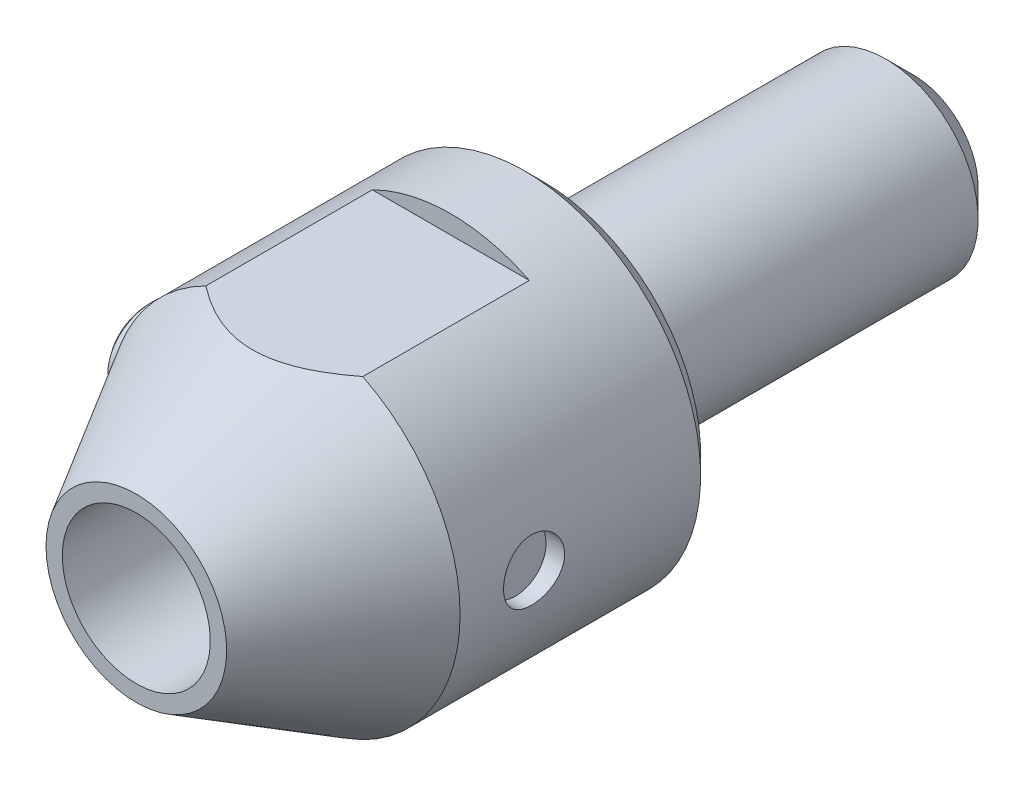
ISO-10303-21;
HEADER;
FILE_DESCRIPTION(('STEP AP214'),'2;1');
FILE_NAME('part.step','',(''),(''),'','','');
FILE_SCHEMA(('AUTOMOTIVE_DESIGN { 1 0 10303 214 1 1 1 1 }'));
ENDSEC;
DATA;
#1=APPLICATION_CONTEXT('core data for automotive mechanical design processes');
#2=APPLICATION_PROTOCOL_DEFINITION('international standard','automotive_design',2000,#1);
#3=PRODUCT_CONTEXT('',#1,'mechanical');
#4=PRODUCT('Part','Part','',(#3));
#5=PRODUCT_RELATED_PRODUCT_CATEGORY('part','',(#4));
#6=PRODUCT_DEFINITION_FORMATION('','',#4);
#7=PRODUCT_DEFINITION_CONTEXT('part definition',#1,'design');
#8=PRODUCT_DEFINITION('design','',#6,#7);
#9=PRODUCT_DEFINITION_SHAPE('','',#8);
#10=(LENGTH_UNIT() NAMED_UNIT(*) SI_UNIT(.MILLI.,.METRE.));
#11=(NAMED_UNIT(*) PLANE_ANGLE_UNIT() SI_UNIT($,.RADIAN.));
#12=(NAMED_UNIT(*) SI_UNIT($,.STERADIAN.) SOLID_ANGLE_UNIT());
#13=UNCERTAINTY_MEASURE_WITH_UNIT(LENGTH_MEASURE(1.E-05),#10,'distance_accuracy_value','');
#14=(GEOMETRIC_REPRESENTATION_CONTEXT(3) GLOBAL_UNCERTAINTY_ASSIGNED_CONTEXT((#13)) GLOBAL_UNIT_ASSIGNED_CONTEXT((#10,
#11,#12)) REPRESENTATION_CONTEXT('',''));
#15=CARTESIAN_POINT('',(0.,0.,0.));
#16=DIRECTION('',(0.,0.,1.));
#17=DIRECTION('',(1.,0.,0.));
#18=AXIS2_PLACEMENT_3D('',#15,#16,#17);
#19=CARTESIAN_POINT('',(-10.9197438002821,0.,9.80046802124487));
#20=DIRECTION('',(0.990268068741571,0.,0.139173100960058));
#21=DIRECTION('',(0.,-1.,0.));
#22=AXIS2_PLACEMENT_3D('',#19,#20,#21);
#23=CYLINDRICAL_SURFACE('',#22,2.5);
#24=CARTESIAN_POINT('',(-10.9197438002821,0.,9.80046802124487));
#25=DIRECTION('',(0.990268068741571,0.,0.139173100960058));
#26=DIRECTION('',(0.,-1.,0.));
#27=AXIS2_PLACEMENT_3D('',#24,#25,#26);
#28=CIRCLE('',#27,2.5);
#29=CARTESIAN_POINT('',(-10.9197438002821,-2.5,9.80046802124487));
#30=VERTEX_POINT('',#29);
#31=EDGE_CURVE('E108',#30,#30,#28,.T.);
#32=ORIENTED_EDGE('',*,*,#31,.T.);
#33=EDGE_LOOP('',(#32));
#34=FACE_BOUND('',#33,.T.);
#35=CARTESIAN_POINT('',(-9.16515138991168,-2.5,10.0470599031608));
#36=CARTESIAN_POINT('',(-9.16515522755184,-2.49999499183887,9.90369510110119));
#37=CARTESIAN_POINT('',(-9.16848757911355,-2.48786505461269,9.76027054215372));
#38=CARTESIAN_POINT('',(-9.18129149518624,-2.44017795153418,9.47758836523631));
#39=CARTESIAN_POINT('',(-9.19076901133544,-2.40459807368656,9.3383349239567));
#40=CARTESIAN_POINT('',(-9.21461263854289,-2.31153661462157,9.0681672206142));
#41=CARTESIAN_POINT('',(-9.22896785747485,-2.25410379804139,8.93723514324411));
#42=CARTESIAN_POINT('',(-9.26090841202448,-2.11905016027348,8.68668843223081));
#43=CARTESIAN_POINT('',(-9.27849380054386,-2.04142900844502,8.56707398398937));
#44=CARTESIAN_POINT('',(-9.31557662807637,-1.86504666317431,8.33849359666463));
#45=CARTESIAN_POINT('',(-9.3351176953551,-1.76567912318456,8.23000154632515));
#46=CARTESIAN_POINT('',(-9.37337809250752,-1.54976735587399,8.03148351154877));
#47=CARTESIAN_POINT('',(-9.39209739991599,-1.43322265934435,7.94145803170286));
#48=CARTESIAN_POINT('',(-9.42636174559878,-1.18700581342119,7.78375464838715));
#49=CARTESIAN_POINT('',(-9.44193537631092,-1.05746958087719,7.71587164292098));
#50=CARTESIAN_POINT('',(-9.46822993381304,-0.787970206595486,7.60411299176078));
#51=CARTESIAN_POINT('',(-9.47895343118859,-0.648012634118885,7.56022462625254));
#52=CARTESIAN_POINT('',(-9.4936823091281,-0.371387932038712,7.50052701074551));
#53=CARTESIAN_POINT('',(-9.49807728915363,-0.235093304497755,7.48308549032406));
#54=CARTESIAN_POINT('',(-9.50090574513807,0.0385133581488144,7.47182342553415));
#55=CARTESIAN_POINT('',(-9.49934096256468,0.175825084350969,7.47799598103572));
#56=CARTESIAN_POINT('',(-9.49064613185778,0.440961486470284,7.51283326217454));
#57=CARTESIAN_POINT('',(-9.48377306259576,0.568933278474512,7.54045971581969));
#58=CARTESIAN_POINT('',(-9.46550492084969,0.818461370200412,7.61580188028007));
#59=CARTESIAN_POINT('',(-9.45410941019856,0.940017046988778,7.66351953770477));
#60=CARTESIAN_POINT('',(-9.42762923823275,1.17657319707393,7.77867624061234));
#61=CARTESIAN_POINT('',(-9.41246292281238,1.29134759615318,7.84655932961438));
#62=CARTESIAN_POINT('',(-9.38009795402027,1.50859092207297,7.99937898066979));
#63=CARTESIAN_POINT('',(-9.36289866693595,1.61105599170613,8.08432086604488));
#64=CARTESIAN_POINT('',(-9.32695336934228,1.80793115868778,8.27504341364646));
#65=CARTESIAN_POINT('',(-9.30818019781,1.9013632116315,8.3818294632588));
#66=CARTESIAN_POINT('',(-9.27217150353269,2.06984953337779,8.60928788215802));
#67=CARTESIAN_POINT('',(-9.25493644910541,2.1448982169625,8.72996445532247));
#68=CARTESIAN_POINT('',(-9.22324530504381,2.27740979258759,8.98737222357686));
#69=CARTESIAN_POINT('',(-9.20893188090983,2.33402689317,9.12455844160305));
#70=CARTESIAN_POINT('',(-9.18581732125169,2.42340958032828,9.40694469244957));
#71=CARTESIAN_POINT('',(-9.17701521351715,2.45617937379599,9.55214330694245));
#72=CARTESIAN_POINT('',(-9.16629028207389,2.49590537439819,9.84280570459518));
#73=CARTESIAN_POINT('',(-9.16420987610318,2.50345303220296,9.98818221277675));
#74=CARTESIAN_POINT('',(-9.16688602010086,2.49363844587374,10.2780210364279));
#75=CARTESIAN_POINT('',(-9.17164039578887,2.47628412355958,10.4224836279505));
#76=CARTESIAN_POINT('',(-9.18710176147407,2.41826293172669,10.6991743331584));
#77=CARTESIAN_POINT('',(-9.197517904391,2.37873231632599,10.8316582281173));
#78=CARTESIAN_POINT('',(-9.2229236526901,2.27823374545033,11.0877536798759));
#79=CARTESIAN_POINT('',(-9.23791310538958,2.21726650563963,11.2113655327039));
#80=CARTESIAN_POINT('',(-9.27058829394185,2.07637729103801,11.4450422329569));
#81=CARTESIAN_POINT('',(-9.28824390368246,1.99666215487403,11.5552362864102));
#82=CARTESIAN_POINT('',(-9.32443932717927,1.82014579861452,11.760796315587));
#83=CARTESIAN_POINT('',(-9.34297922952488,1.72334286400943,11.8561608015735));
#84=CARTESIAN_POINT('',(-9.37932911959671,1.51319441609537,12.0314665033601));
#85=CARTESIAN_POINT('',(-9.39711747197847,1.39956005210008,12.1110660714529));
#86=CARTESIAN_POINT('',(-9.42964304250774,1.16034004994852,12.2504772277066));
#87=CARTESIAN_POINT('',(-9.44438011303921,1.03475383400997,12.3102878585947));
#88=CARTESIAN_POINT('',(-9.46935504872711,0.773732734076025,12.4091250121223));
#89=CARTESIAN_POINT('',(-9.47954521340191,0.638210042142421,12.4479320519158));
#90=CARTESIAN_POINT('',(-9.49409210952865,0.362333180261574,12.5027855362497));
#91=CARTESIAN_POINT('',(-9.49844911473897,0.221979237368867,12.5188330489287));
#92=CARTESIAN_POINT('',(-9.50084850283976,-0.0586058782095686,12.5277075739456));
#93=CARTESIAN_POINT('',(-9.49893143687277,-0.198832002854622,12.52068370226));
#94=CARTESIAN_POINT('',(-9.48907855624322,-0.476057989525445,12.4839325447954));
#95=CARTESIAN_POINT('',(-9.48114272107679,-0.613057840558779,12.4542051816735));
#96=CARTESIAN_POINT('',(-9.46012310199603,-0.879741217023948,12.3729007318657));
#97=CARTESIAN_POINT('',(-9.44704781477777,-1.00943641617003,12.3213596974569));
#98=CARTESIAN_POINT('',(-9.41714929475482,-1.25817629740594,12.1977440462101));
#99=CARTESIAN_POINT('',(-9.40032583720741,-1.37722034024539,12.1256681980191));
#100=CARTESIAN_POINT('',(-9.36461387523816,-1.60221560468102,11.9621693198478));
#101=CARTESIAN_POINT('',(-9.34571103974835,-1.70806365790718,11.8706073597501));
#102=CARTESIAN_POINT('',(-9.30804814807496,-1.90265208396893,11.6707626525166));
#103=CARTESIAN_POINT('',(-9.28928810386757,-1.99139103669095,11.5624785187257));
#104=CARTESIAN_POINT('',(-9.25414114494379,-2.14880601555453,11.3325879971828));
#105=CARTESIAN_POINT('',(-9.23774376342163,-2.21757199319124,11.211044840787));
#106=CARTESIAN_POINT('',(-9.20914126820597,-2.33351936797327,10.9576840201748));
#107=CARTESIAN_POINT('',(-9.19693269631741,-2.380718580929,10.8258749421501));
#108=CARTESIAN_POINT('',(-9.18021134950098,-2.4442845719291,10.5861571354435));
#109=CARTESIAN_POINT('',(-9.17458765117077,-2.46518799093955,10.4795027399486));
#110=CARTESIAN_POINT('',(-9.16705620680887,-2.49304764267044,10.2642636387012));
#111=CARTESIAN_POINT('',(-9.16514848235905,-2.50000379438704,10.1556789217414));
#112=CARTESIAN_POINT('',(-9.16515138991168,-2.5,10.0470599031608));
#113=B_SPLINE_CURVE_WITH_KNOTS('',3,(#35,#36,#37,#38,#39,#40,#41,#42,#43,#44,#45,#46,#47,#48,
#49,#50,#51,#52,#53,#54,#55,#56,#57,#58,#59,#60,#61,#62,#63,#64,#65,#66,#67,#68,#69,#70,#71,#72,
#73,#74,#75,#76,#77,#78,#79,#80,#81,#82,#83,#84,#85,#86,#87,#88,#89,#90,#91,#92,#93,#94,#95,#96,
#97,#98,#99,#100,#101,#102,#103,#104,#105,#106,#107,#108,#109,#110,#111,#112),.UNSPECIFIED.,.T.,
.F.,(4,2,2,2,2,2,2,2,2,2,2,2,2,2,2,2,2,2,2,2,2,2,2,2,2,2,2,2,2,2,2,2,2,2,2,2,2,2,4),(0.,
0.429680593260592,0.859777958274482,1.28892114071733,1.71807135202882,2.16120315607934,
2.60434706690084,3.04326124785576,3.48194252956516,3.89225538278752,4.30244835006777,
4.69394018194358,5.08546995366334,5.48635636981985,5.88736808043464,6.31484802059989,
6.74245767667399,7.18757441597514,7.63261261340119,8.06713871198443,8.50152660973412,
8.91545946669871,9.32937850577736,9.73892905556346,10.1485207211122,10.566198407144,
10.9838962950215,11.4058786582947,11.827841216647,12.2470819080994,12.6663240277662,
13.0848759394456,13.5034529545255,13.9251207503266,14.3468235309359,14.7665965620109,
15.1860221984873,15.511563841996,15.837107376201),.UNSPECIFIED.);
#114=CARTESIAN_POINT('',(-9.16515138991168,-2.5,10.0470599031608));
#115=VERTEX_POINT('',#114);
#116=EDGE_CURVE('E20',#115,#115,#113,.T.);
#117=ORIENTED_EDGE('',*,*,#116,.F.);
#118=EDGE_LOOP('',(#117));
#119=FACE_BOUND('',#118,.T.);
#120=ADVANCED_FACE('F16',(#34,#119),#23,.T.);
#121=CARTESIAN_POINT('',(-8.79208017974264,-1.25,10.8282719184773));
#122=DIRECTION('',(-0.120527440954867,-0.5,0.857597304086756));
#123=DIRECTION('',(0.0695865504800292,-0.866025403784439,-0.495134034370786));
#124=AXIS2_PLACEMENT_3D('',#121,#122,#123);
#125=PLANE('',#124);
#126=DIRECTION('',(-0.990268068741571,0.,-0.139173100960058));
#127=VECTOR('',#126,1.);
#128=CARTESIAN_POINT('',(-8.79208017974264,-1.25,10.8282719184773));
#129=LINE('',#128,#127);
#130=CARTESIAN_POINT('',(-8.79208017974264,-1.25,10.8282719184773));
#131=VERTEX_POINT('',#130);
#132=CARTESIAN_POINT('',(-11.2677503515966,-1.25,10.4803391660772));
#133=VERTEX_POINT('',#132);
#134=EDGE_CURVE('E104',#131,#133,#129,.T.);
#135=ORIENTED_EDGE('',*,*,#134,.T.);
#136=DIRECTION('',(-0.0695865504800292,0.866025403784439,0.495134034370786));
#137=VECTOR('',#136,1.);
#138=CARTESIAN_POINT('',(-11.2677503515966,-1.25,10.4803391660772));
#139=LINE('',#138,#137);
#140=CARTESIAN_POINT('',(-11.3681898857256,0.,11.1950035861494));
#141=VERTEX_POINT('',#140);
#142=EDGE_CURVE('E37',#133,#141,#139,.T.);
#143=ORIENTED_EDGE('',*,*,#142,.T.);
#144=DIRECTION('',(-0.990268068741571,0.,-0.139173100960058));
#145=VECTOR('',#144,1.);
#146=CARTESIAN_POINT('',(-8.8925197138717,0.,11.5429363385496));
#147=LINE('',#146,#145);
#148=CARTESIAN_POINT('',(-8.8925197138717,0.,11.5429363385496));
#149=VERTEX_POINT('',#148);
#150=EDGE_CURVE('E42',#149,#141,#147,.T.);
#151=ORIENTED_EDGE('',*,*,#150,.F.);
#152=DIRECTION('',(-0.0695865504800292,0.866025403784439,0.495134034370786));
#153=VECTOR('',#152,1.);
#154=CARTESIAN_POINT('',(-8.79208017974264,-1.25,10.8282719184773));
#155=LINE('',#154,#153);
#156=EDGE_CURVE('E98',#131,#149,#155,.T.);
#157=ORIENTED_EDGE('',*,*,#156,.F.);
#158=EDGE_LOOP('',(#135,#143,#151,#157));
#159=FACE_BOUND('',#158,.T.);
#160=ADVANCED_FACE('F118',(#159),#125,.F.);
#161=CARTESIAN_POINT('',(-8.59120111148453,-1.25,9.39894307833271));
#162=DIRECTION('',(0.,-1.,0.));
#163=DIRECTION('',(0.139173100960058,0.,-0.990268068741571));
#164=AXIS2_PLACEMENT_3D('',#161,#162,#163);
#165=PLANE('',#164);
#166=DIRECTION('',(-0.990268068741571,0.,-0.139173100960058));
#167=VECTOR('',#166,1.);
#168=CARTESIAN_POINT('',(-8.59120111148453,-1.25,9.39894307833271));
#169=LINE('',#168,#167);
#170=CARTESIAN_POINT('',(-8.59120111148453,-1.25,9.39894307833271));
#171=VERTEX_POINT('',#170);
#172=CARTESIAN_POINT('',(-11.0668712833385,-1.25,9.05101032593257));
#173=VERTEX_POINT('',#172);
#174=EDGE_CURVE('E101',#171,#173,#169,.T.);
#175=ORIENTED_EDGE('',*,*,#174,.T.);
#176=DIRECTION('',(-0.139173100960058,0.,0.990268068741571));
#177=VECTOR('',#176,1.);
#178=CARTESIAN_POINT('',(-11.0668712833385,-1.25,9.05101032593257));
#179=LINE('',#178,#177);
#180=EDGE_CURVE('E190',#173,#133,#179,.T.);
#181=ORIENTED_EDGE('',*,*,#180,.T.);
#182=ORIENTED_EDGE('',*,*,#134,.F.);
#183=DIRECTION('',(-0.139173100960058,0.,0.990268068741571));
#184=VECTOR('',#183,1.);
#185=CARTESIAN_POINT('',(-8.59120111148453,-1.25,9.39894307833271));
#186=LINE('',#185,#184);
#187=EDGE_CURVE('E93',#171,#131,#186,.T.);
#188=ORIENTED_EDGE('',*,*,#187,.F.);
#189=EDGE_LOOP('',(#175,#181,#182,#188));
#190=FACE_BOUND('',#189,.T.);
#191=ADVANCED_FACE('F124',(#190),#165,.F.);
#192=CARTESIAN_POINT('',(-8.59120111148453,-1.25,9.39894307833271));
#193=DIRECTION('',(-0.120527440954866,0.5,0.857597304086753));
#194=DIRECTION('',(-0.0695865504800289,-0.866025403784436,0.495134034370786));
#195=AXIS2_PLACEMENT_3D('',#192,#193,#194);
#196=PLANE('',#195);
#197=DIRECTION('',(-0.990268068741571,0.,-0.139173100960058));
#198=VECTOR('',#197,1.);
#199=CARTESIAN_POINT('',(-8.49076157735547,0.,8.68427865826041));
#200=LINE('',#199,#198);
#201=CARTESIAN_POINT('',(-8.49076157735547,0.,8.68427865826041));
#202=VERTEX_POINT('',#201);
#203=CARTESIAN_POINT('',(-10.9664317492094,0.,8.33634590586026));
#204=VERTEX_POINT('',#203);
#205=EDGE_CURVE('E76',#202,#204,#200,.T.);
#206=ORIENTED_EDGE('',*,*,#205,.T.);
#207=DIRECTION('',(0.0695865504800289,0.866025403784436,-0.495134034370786));
#208=VECTOR('',#207,1.);
#209=CARTESIAN_POINT('',(-11.0668712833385,-1.25,9.05101032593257));
#210=LINE('',#209,#208);
#211=EDGE_CURVE('E334',#173,#204,#210,.T.);
#212=ORIENTED_EDGE('',*,*,#211,.F.);
#213=ORIENTED_EDGE('',*,*,#174,.F.);
#214=DIRECTION('',(0.0695865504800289,0.866025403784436,-0.495134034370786));
#215=VECTOR('',#214,1.);
#216=CARTESIAN_POINT('',(-8.59120111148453,-1.25,9.39894307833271));
#217=LINE('',#216,#215);
#218=EDGE_CURVE('E91',#171,#202,#217,.T.);
#219=ORIENTED_EDGE('',*,*,#218,.T.);
#220=EDGE_LOOP('',(#206,#212,#213,#219));
#221=FACE_BOUND('',#220,.T.);
#222=ADVANCED_FACE('F303',(#221),#196,.T.);
#223=CARTESIAN_POINT('',(-8.59120111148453,1.25,9.39894307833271));
#224=DIRECTION('',(0.120527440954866,0.5,-0.857597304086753));
#225=DIRECTION('',(-0.0695865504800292,0.866025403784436,0.495134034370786));
#226=AXIS2_PLACEMENT_3D('',#223,#224,#225);
#227=PLANE('',#226);
#228=DIRECTION('',(-0.990268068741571,0.,-0.139173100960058));
#229=VECTOR('',#228,1.);
#230=CARTESIAN_POINT('',(-8.59120111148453,1.25,9.39894307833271));
#231=LINE('',#230,#229);
#232=CARTESIAN_POINT('',(-8.59120111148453,1.25,9.39894307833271));
#233=VERTEX_POINT('',#232);
#234=CARTESIAN_POINT('',(-11.0668712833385,1.25,9.05101032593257));
#235=VERTEX_POINT('',#234);
#236=EDGE_CURVE('E64',#233,#235,#231,.T.);
#237=ORIENTED_EDGE('',*,*,#236,.T.);
#238=DIRECTION('',(0.0695865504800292,-0.866025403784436,-0.495134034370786));
#239=VECTOR('',#238,1.);
#240=CARTESIAN_POINT('',(-11.0668712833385,1.25,9.05101032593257));
#241=LINE('',#240,#239);
#242=EDGE_CURVE('E329',#235,#204,#241,.T.);
#243=ORIENTED_EDGE('',*,*,#242,.T.);
#244=ORIENTED_EDGE('',*,*,#205,.F.);
#245=DIRECTION('',(0.0695865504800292,-0.866025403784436,-0.495134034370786));
#246=VECTOR('',#245,1.);
#247=CARTESIAN_POINT('',(-8.59120111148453,1.25,9.39894307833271));
#248=LINE('',#247,#246);
#249=EDGE_CURVE('E84',#233,#202,#248,.T.);
#250=ORIENTED_EDGE('',*,*,#249,.F.);
#251=EDGE_LOOP('',(#237,#243,#244,#250));
#252=FACE_BOUND('',#251,.T.);
#253=ADVANCED_FACE('F89',(#252),#227,.F.);
#254=CARTESIAN_POINT('',(-8.59120111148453,1.25,9.39894307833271));
#255=DIRECTION('',(0.,-1.,0.));
#256=DIRECTION('',(-0.990268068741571,0.,-0.139173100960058));
#257=AXIS2_PLACEMENT_3D('',#254,#255,#256);
#258=PLANE('',#257);
#259=DIRECTION('',(-0.990268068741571,0.,-0.139173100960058));
#260=VECTOR('',#259,1.);
#261=CARTESIAN_POINT('',(-8.79208017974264,1.25,10.8282719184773));
#262=LINE('',#261,#260);
#263=CARTESIAN_POINT('',(-8.79208017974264,1.25,10.8282719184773));
#264=VERTEX_POINT('',#263);
#265=CARTESIAN_POINT('',(-11.2677503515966,1.25,10.4803391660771));
#266=VERTEX_POINT('',#265);
#267=EDGE_CURVE('E77',#264,#266,#262,.T.);
#268=ORIENTED_EDGE('',*,*,#267,.T.);
#269=DIRECTION('',(-0.139173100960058,0.,0.990268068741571));
#270=VECTOR('',#269,1.);
#271=CARTESIAN_POINT('',(-11.0668712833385,1.25,9.05101032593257));
#272=LINE('',#271,#270);
#273=EDGE_CURVE('E71',#235,#266,#272,.T.);
#274=ORIENTED_EDGE('',*,*,#273,.F.);
#275=ORIENTED_EDGE('',*,*,#236,.F.);
#276=DIRECTION('',(-0.139173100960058,0.,0.990268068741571));
#277=VECTOR('',#276,1.);
#278=CARTESIAN_POINT('',(-8.59120111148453,1.25,9.39894307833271));
#279=LINE('',#278,#277);
#280=EDGE_CURVE('E68',#233,#264,#279,.T.);
#281=ORIENTED_EDGE('',*,*,#280,.T.);
#282=EDGE_LOOP('',(#268,#274,#275,#281));
#283=FACE_BOUND('',#282,.T.);
#284=ADVANCED_FACE('F67',(#283),#258,.T.);
#285=CARTESIAN_POINT('',(-8.79208017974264,1.25,10.8282719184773));
#286=DIRECTION('',(0.120527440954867,-0.5,-0.857597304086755));
#287=DIRECTION('',(0.0695865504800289,0.866025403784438,-0.495134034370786));
#288=AXIS2_PLACEMENT_3D('',#285,#286,#287);
#289=PLANE('',#288);
#290=DIRECTION('',(-0.0695865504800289,-0.866025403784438,0.495134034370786));
#291=VECTOR('',#290,1.);
#292=CARTESIAN_POINT('',(-8.79208017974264,1.25,10.8282719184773));
#293=LINE('',#292,#291);
#294=EDGE_CURVE('E87',#264,#149,#293,.T.);
#295=ORIENTED_EDGE('',*,*,#294,.T.);
#296=ORIENTED_EDGE('',*,*,#150,.T.);
#297=DIRECTION('',(-0.0695865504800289,-0.866025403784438,0.495134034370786));
#298=VECTOR('',#297,1.);
#299=CARTESIAN_POINT('',(-11.2677503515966,1.25,10.4803391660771));
#300=LINE('',#299,#298);
#301=EDGE_CURVE('E323',#266,#141,#300,.T.);
#302=ORIENTED_EDGE('',*,*,#301,.F.);
#303=ORIENTED_EDGE('',*,*,#267,.F.);
#304=EDGE_LOOP('',(#295,#296,#302,#303));
#305=FACE_BOUND('',#304,.T.);
#306=ADVANCED_FACE('F294',(#305),#289,.T.);
#307=CARTESIAN_POINT('',(-8.69164064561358,-2.5,10.113607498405));
#308=DIRECTION('',(-0.990268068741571,0.,-0.139173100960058));
#309=DIRECTION('',(0.,1.,0.));
#310=AXIS2_PLACEMENT_3D('',#307,#308,#309);
#311=PLANE('',#310);
#312=ORIENTED_EDGE('',*,*,#156,.T.);
#313=ORIENTED_EDGE('',*,*,#294,.F.);
#314=ORIENTED_EDGE('',*,*,#280,.F.);
#315=ORIENTED_EDGE('',*,*,#249,.T.);
#316=ORIENTED_EDGE('',*,*,#218,.F.);
#317=ORIENTED_EDGE('',*,*,#187,.T.);
#318=EDGE_LOOP('',(#312,#313,#314,#315,#316,#317));
#319=FACE_BOUND('',#318,.T.);
#320=ADVANCED_FACE('F82',(#319),#311,.T.);
#321=CARTESIAN_POINT('',(-10.9197438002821,0.,9.80046802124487));
#322=DIRECTION('',(0.990268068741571,0.,0.139173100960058));
#323=DIRECTION('',(0.,-1.,0.));
#324=AXIS2_PLACEMENT_3D('',#321,#322,#323);
#325=CONICAL_SURFACE('',#324,2.5,0.785398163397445);
#326=CARTESIAN_POINT('',(-11.1673108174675,0.,9.76567474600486));
#327=DIRECTION('',(0.990268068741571,0.,0.139173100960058));
#328=DIRECTION('',(0.,-1.,0.));
#329=AXIS2_PLACEMENT_3D('',#326,#327,#328);
#330=CIRCLE('',#329,2.25);
#331=CARTESIAN_POINT('',(-11.1673108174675,-2.25000000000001,9.76567474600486));
#332=VERTEX_POINT('',#331);
#333=EDGE_CURVE('E106',#332,#332,#330,.T.);
#334=CARTESIAN_POINT('',(-11.1673108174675,-2.25000000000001,9.76567474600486));
#335=CARTESIAN_POINT('',(-11.1647319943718,-2.25260416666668,9.76603717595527));
#336=CARTESIAN_POINT('',(-11.1621531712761,-2.25520833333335,9.76639960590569));
#337=CARTESIAN_POINT('',(-11.1569955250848,-2.26041666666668,9.76712446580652));
#338=CARTESIAN_POINT('',(-11.1544167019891,-2.26302083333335,9.76748689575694));
#339=CARTESIAN_POINT('',(-11.1492590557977,-2.26822916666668,9.76821175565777));
#340=CARTESIAN_POINT('',(-11.1466802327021,-2.27083333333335,9.76857418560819));
#341=CARTESIAN_POINT('',(-11.1415225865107,-2.27604166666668,9.76929904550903));
#342=CARTESIAN_POINT('',(-11.138943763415,-2.27864583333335,9.76966147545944));
#343=CARTESIAN_POINT('',(-11.1337861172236,-2.28385416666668,9.77038633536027));
#344=CARTESIAN_POINT('',(-11.131207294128,-2.28645833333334,9.77074876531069));
#345=CARTESIAN_POINT('',(-11.1260496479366,-2.29166666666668,9.77147362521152));
#346=CARTESIAN_POINT('',(-11.1234708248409,-2.29427083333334,9.77183605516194));
#347=CARTESIAN_POINT('',(-11.1183131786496,-2.29947916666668,9.77256091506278));
#348=CARTESIAN_POINT('',(-11.1157343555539,-2.30208333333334,9.77292334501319));
#349=CARTESIAN_POINT('',(-11.1105767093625,-2.30729166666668,9.77364820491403));
#350=CARTESIAN_POINT('',(-11.1079978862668,-2.30989583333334,9.77401063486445));
#351=CARTESIAN_POINT('',(-11.1028402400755,-2.31510416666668,9.77473549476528));
#352=CARTESIAN_POINT('',(-11.1002614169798,-2.31770833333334,9.77509792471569));
#353=CARTESIAN_POINT('',(-11.0951037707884,-2.32291666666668,9.77582278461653));
#354=CARTESIAN_POINT('',(-11.0925249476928,-2.32552083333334,9.77618521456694));
#355=CARTESIAN_POINT('',(-11.0873673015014,-2.33072916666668,9.77691007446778));
#356=CARTESIAN_POINT('',(-11.0847884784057,-2.33333333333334,9.7772725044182));
#357=CARTESIAN_POINT('',(-11.0796308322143,-2.33854166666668,9.77799736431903));
#358=CARTESIAN_POINT('',(-11.0770520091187,-2.34114583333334,9.77835979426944));
#359=CARTESIAN_POINT('',(-11.0718943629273,-2.34635416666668,9.77908465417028));
#360=CARTESIAN_POINT('',(-11.0693155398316,-2.34895833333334,9.7794470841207));
#361=CARTESIAN_POINT('',(-11.0641578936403,-2.35416666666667,9.78017194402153));
#362=CARTESIAN_POINT('',(-11.0615790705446,-2.35677083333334,9.78053437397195));
#363=CARTESIAN_POINT('',(-11.0564214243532,-2.36197916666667,9.78125923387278));
#364=CARTESIAN_POINT('',(-11.0538426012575,-2.36458333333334,9.7816216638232));
#365=CARTESIAN_POINT('',(-11.0486849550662,-2.36979166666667,9.78234652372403));
#366=CARTESIAN_POINT('',(-11.0461061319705,-2.37239583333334,9.78270895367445));
#367=CARTESIAN_POINT('',(-11.0409484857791,-2.37760416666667,9.78343381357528));
#368=CARTESIAN_POINT('',(-11.0383696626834,-2.38020833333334,9.7837962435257));
#369=CARTESIAN_POINT('',(-11.0332120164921,-2.38541666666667,9.78452110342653));
#370=CARTESIAN_POINT('',(-11.0306331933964,-2.38802083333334,9.78488353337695));
#371=CARTESIAN_POINT('',(-11.025475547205,-2.39322916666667,9.78560839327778));
#372=CARTESIAN_POINT('',(-11.0228967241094,-2.39583333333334,9.7859708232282));
#373=CARTESIAN_POINT('',(-11.017739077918,-2.40104166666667,9.78669568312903));
#374=CARTESIAN_POINT('',(-11.0151602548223,-2.40364583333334,9.78705811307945));
#375=CARTESIAN_POINT('',(-11.010002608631,-2.40885416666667,9.78778297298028));
#376=CARTESIAN_POINT('',(-11.0074237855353,-2.41145833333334,9.7881454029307));
#377=CARTESIAN_POINT('',(-11.0022661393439,-2.41666666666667,9.78887026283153));
#378=CARTESIAN_POINT('',(-10.9996873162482,-2.41927083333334,9.78923269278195));
#379=CARTESIAN_POINT('',(-10.9945296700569,-2.42447916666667,9.78995755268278));
#380=CARTESIAN_POINT('',(-10.9919508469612,-2.42708333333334,9.7903199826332));
#381=CARTESIAN_POINT('',(-10.9867932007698,-2.43229166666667,9.79104484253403));
#382=CARTESIAN_POINT('',(-10.9842143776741,-2.43489583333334,9.79140727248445));
#383=CARTESIAN_POINT('',(-10.9790567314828,-2.44010416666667,9.79213213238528));
#384=CARTESIAN_POINT('',(-10.9764779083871,-2.44270833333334,9.7924945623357));
#385=CARTESIAN_POINT('',(-10.9713202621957,-2.44791666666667,9.79321942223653));
#386=CARTESIAN_POINT('',(-10.9687414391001,-2.45052083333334,9.79358185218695));
#387=CARTESIAN_POINT('',(-10.9635837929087,-2.45572916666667,9.79430671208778));
#388=CARTESIAN_POINT('',(-10.961004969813,-2.45833333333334,9.7946691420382));
#389=CARTESIAN_POINT('',(-10.9558473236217,-2.46354166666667,9.79539400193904));
#390=CARTESIAN_POINT('',(-10.953268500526,-2.46614583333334,9.79575643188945));
#391=CARTESIAN_POINT('',(-10.9481108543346,-2.47135416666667,9.79648129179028));
#392=CARTESIAN_POINT('',(-10.9455320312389,-2.47395833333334,9.7968437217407));
#393=CARTESIAN_POINT('',(-10.9403743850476,-2.47916666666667,9.79756858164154));
#394=CARTESIAN_POINT('',(-10.9377955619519,-2.48177083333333,9.79793101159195));
#395=CARTESIAN_POINT('',(-10.9326379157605,-2.48697916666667,9.79865587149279));
#396=CARTESIAN_POINT('',(-10.9300590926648,-2.48958333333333,9.7990183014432));
#397=CARTESIAN_POINT('',(-10.9249014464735,-2.49479166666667,9.79974316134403));
#398=CARTESIAN_POINT('',(-10.9223226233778,-2.49739583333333,9.80010559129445));
#399=CARTESIAN_POINT('',(-10.9197438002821,-2.5,9.80046802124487));
#400=B_SPLINE_CURVE_WITH_KNOTS('',3,(#334,#335,#336,#337,#338,#339,#340,#341,#342,#343,#344,
#345,#346,#347,#348,#349,#350,#351,#352,#353,#354,#355,#356,#357,#358,#359,#360,#361,#362,#363,
#364,#365,#366,#367,#368,#369,#370,#371,#372,#373,#374,#375,#376,#377,#378,#379,#380,#381,#382,
#383,#384,#385,#386,#387,#388,#389,#390,#391,#392,#393,#394,#395,#396,#397,#398,#399),
.UNSPECIFIED.,.F.,.F.,(4,2,2,2,2,2,2,2,2,2,2,2,2,2,2,2,2,2,2,2,2,2,2,2,2,2,2,2,2,2,2,2,4),(0.,
0.0110485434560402,0.0220970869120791,0.0331456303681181,0.0441941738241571,0.0552427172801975,
0.0662912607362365,0.0773398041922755,0.0883883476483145,0.0994368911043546,0.110485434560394,
0.121533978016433,0.132582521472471,0.143631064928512,0.154679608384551,0.16572815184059,
0.176776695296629,0.187825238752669,0.198873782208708,0.209922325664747,0.220970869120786,
0.232019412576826,0.243067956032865,0.254116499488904,0.265165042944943,0.276213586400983,
0.287262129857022,0.298310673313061,0.3093592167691,0.320407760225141,0.33145630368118,
0.342504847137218,0.353553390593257),.UNSPECIFIED.);
#401=EDGE_CURVE('BSEAM128',#332,#30,#400,.T.);
#402=ORIENTED_EDGE('',*,*,#333,.T.);
#403=ORIENTED_EDGE('',*,*,#31,.F.);
#404=ORIENTED_EDGE('',*,*,#401,.T.);
#405=ORIENTED_EDGE('',*,*,#401,.F.);
#406=EDGE_LOOP('',(#402,#404,#403,#405));
#407=FACE_BOUND('',#406,.T.);
#408=ADVANCED_FACE('F128',(#407),#325,.T.);
#409=CARTESIAN_POINT('',(-11.1673108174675,0.,9.76567474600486));
#410=DIRECTION('',(0.990268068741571,0.,0.139173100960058));
#411=DIRECTION('',(0.,-1.,0.));
#412=AXIS2_PLACEMENT_3D('',#409,#410,#411);
#413=PLANE('',#412);
#414=ORIENTED_EDGE('',*,*,#301,.T.);
#415=ORIENTED_EDGE('',*,*,#142,.F.);
#416=ORIENTED_EDGE('',*,*,#180,.F.);
#417=ORIENTED_EDGE('',*,*,#211,.T.);
#418=ORIENTED_EDGE('',*,*,#242,.F.);
#419=ORIENTED_EDGE('',*,*,#273,.T.);
#420=EDGE_LOOP('',(#414,#415,#416,#417,#418,#419));
#421=FACE_BOUND('',#420,.T.);
#422=ORIENTED_EDGE('',*,*,#333,.F.);
#423=EDGE_LOOP('',(#422));
#424=FACE_BOUND('',#423,.T.);
#425=ADVANCED_FACE('F309',(#421,#424),#413,.F.);
#426=CARTESIAN_POINT('',(0.,0.,-15.004417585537));
#427=DIRECTION('',(0.,0.,-1.));
#428=DIRECTION('',(-1.,0.,0.));
#429=AXIS2_PLACEMENT_3D('',#426,#427,#428);
#430=CYLINDRICAL_SURFACE('',#429,5.);
#431=CARTESIAN_POINT('',(0.,0.,-18.5));
#432=DIRECTION('',(0.,0.,-1.));
#433=DIRECTION('',(-1.,0.,0.));
#434=AXIS2_PLACEMENT_3D('',#431,#432,#433);
#435=CIRCLE('',#434,5.);
#436=CARTESIAN_POINT('',(-5.,0.,-18.5));
#437=VERTEX_POINT('',#436);
#438=EDGE_CURVE('E155',#437,#437,#435,.T.);
#439=ORIENTED_EDGE('',*,*,#438,.F.);
#440=EDGE_LOOP('',(#439));
#441=FACE_BOUND('',#440,.T.);
#442=CARTESIAN_POINT('',(0.,0.,0.));
#443=DIRECTION('',(0.,0.,1.));
#444=DIRECTION('',(1.,0.,0.));
#445=AXIS2_PLACEMENT_3D('',#442,#443,#444);
#446=CIRCLE('',#445,5.);
#447=CARTESIAN_POINT('',(5.,0.,0.));
#448=VERTEX_POINT('',#447);
#449=EDGE_CURVE('E360',#448,#448,#446,.T.);
#450=ORIENTED_EDGE('',*,*,#449,.F.);
#451=EDGE_LOOP('',(#450));
#452=FACE_BOUND('',#451,.T.);
#453=ADVANCED_FACE('F311',(#441,#452),#430,.T.);
#454=CARTESIAN_POINT('',(0.,0.,-18.5));
#455=DIRECTION('',(0.,0.,1.));
#456=DIRECTION('',(1.,0.,0.));
#457=AXIS2_PLACEMENT_3D('',#454,#455,#456);
#458=CONICAL_SURFACE('',#457,5.,0.785398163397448);
#459=CARTESIAN_POINT('',(0.,0.,-20.));
#460=DIRECTION('',(0.,0.,-1.));
#461=DIRECTION('',(-1.,0.,0.));
#462=AXIS2_PLACEMENT_3D('',#459,#460,#461);
#463=CIRCLE('',#462,3.5);
#464=CARTESIAN_POINT('',(-3.5,0.,-20.));
#465=VERTEX_POINT('',#464);
#466=EDGE_CURVE('E152',#465,#465,#463,.T.);
#467=ORIENTED_EDGE('',*,*,#466,.F.);
#468=EDGE_LOOP('',(#467));
#469=FACE_BOUND('',#468,.T.);
#470=ORIENTED_EDGE('',*,*,#438,.T.);
#471=EDGE_LOOP('',(#470));
#472=FACE_BOUND('',#471,.T.);
#473=ADVANCED_FACE('F317',(#469,#472),#458,.T.);
#474=CARTESIAN_POINT('',(3.5,0.,-20.));
#475=DIRECTION('',(0.,0.,1.));
#476=DIRECTION('',(1.,0.,0.));
#477=AXIS2_PLACEMENT_3D('',#474,#475,#476);
#478=PLANE('',#477);
#479=ORIENTED_EDGE('',*,*,#466,.T.);
#480=EDGE_LOOP('',(#479));
#481=FACE_BOUND('',#480,.T.);
#482=ADVANCED_FACE('F203',(#481),#478,.F.);
#483=CARTESIAN_POINT('',(13.2740740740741,-14.0111111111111,5.));
#484=DIRECTION('',(0.,0.,1.));
#485=DIRECTION('',(1.,0.,0.));
#486=AXIS2_PLACEMENT_3D('',#483,#484,#485);
#487=PLANE('',#486);
#488=CARTESIAN_POINT('',(0.,0.,5.));
#489=DIRECTION('',(0.,0.,1.));
#490=DIRECTION('',(1.,0.,0.));
#491=AXIS2_PLACEMENT_3D('',#488,#489,#490);
#492=CIRCLE('',#491,9.5);
#493=CARTESIAN_POINT('',(-4.24264068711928,-8.5,5.));
#494=VERTEX_POINT('',#493);
#495=CARTESIAN_POINT('',(4.24264068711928,-8.5,5.));
#496=VERTEX_POINT('',#495);
#497=EDGE_CURVE('E175',#494,#496,#492,.T.);
#498=ORIENTED_EDGE('',*,*,#497,.T.);
#499=DIRECTION('',(-1.,0.,0.));
#500=VECTOR('',#499,1.);
#501=CARTESIAN_POINT('',(-12.9777777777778,-8.5,5.));
#502=LINE('',#501,#500);
#503=EDGE_CURVE('E220',#496,#494,#502,.T.);
#504=ORIENTED_EDGE('',*,*,#503,.T.);
#505=EDGE_LOOP('',(#498,#504));
#506=FACE_BOUND('',#505,.T.);
#507=ADVANCED_FACE('F199',(#506),#487,.T.);
#508=CARTESIAN_POINT('',(-12.9777777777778,-8.5,5.));
#509=DIRECTION('',(0.,1.,0.));
#510=DIRECTION('',(0.,0.,1.));
#511=AXIS2_PLACEMENT_3D('',#508,#509,#510);
#512=PLANE('',#511);
#513=CARTESIAN_POINT('',(-11.2948804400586,-8.5,5.97034551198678));
#514=CARTESIAN_POINT('',(-11.1012702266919,-8.5,6.238262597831));
#515=CARTESIAN_POINT('',(-10.9065004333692,-8.5,6.50534835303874));
#516=CARTESIAN_POINT('',(-10.5142434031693,-8.5,7.03754475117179));
#517=CARTESIAN_POINT('',(-10.3167559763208,-8.5,7.30265525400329));
#518=CARTESIAN_POINT('',(-9.91825207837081,-8.5,7.83113501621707));
#519=CARTESIAN_POINT('',(-9.7172287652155,-8.5,8.0944991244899));
#520=CARTESIAN_POINT('',(-9.31159460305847,-8.5,8.61844426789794));
#521=CARTESIAN_POINT('',(-9.10698383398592,-8.5,8.8790253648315));
#522=CARTESIAN_POINT('',(-8.68421863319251,-8.5,9.4085776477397));
#523=CARTESIAN_POINT('',(-8.46587044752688,-8.5,9.67739449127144));
#524=CARTESIAN_POINT('',(-8.02376944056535,-8.5,10.2105436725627));
#525=CARTESIAN_POINT('',(-7.80001679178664,-8.5,10.4748761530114));
#526=CARTESIAN_POINT('',(-7.34624954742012,-8.5,10.9977081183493));
#527=CARTESIAN_POINT('',(-7.11624083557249,-8.5,11.2562126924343));
#528=CARTESIAN_POINT('',(-6.64845621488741,-8.5,11.7660708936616));
#529=CARTESIAN_POINT('',(-6.41068124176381,-8.5,12.0174253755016));
#530=CARTESIAN_POINT('',(-5.91764934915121,-8.5,12.5189806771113));
#531=CARTESIAN_POINT('',(-5.66207459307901,-8.5,12.7688709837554));
#532=CARTESIAN_POINT('',(-5.13820420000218,-8.5,13.2554549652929));
#533=CARTESIAN_POINT('',(-4.86990002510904,-8.5,13.4921395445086));
#534=CARTESIAN_POINT('',(-4.32100945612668,-8.5,13.9441737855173));
#535=CARTESIAN_POINT('',(-4.04060381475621,-8.5,14.1597409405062));
#536=CARTESIAN_POINT('',(-3.4615991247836,-8.5,14.5646140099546));
#537=CARTESIAN_POINT('',(-3.16303159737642,-8.5,14.7539636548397));
#538=CARTESIAN_POINT('',(-2.72436176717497,-8.5,14.9957844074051));
#539=CARTESIAN_POINT('',(-2.59285642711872,-8.5,15.0639175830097));
#540=CARTESIAN_POINT('',(-2.32577323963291,-8.5,15.1924988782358));
#541=CARTESIAN_POINT('',(-2.19018752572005,-8.5,15.2529307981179));
#542=CARTESIAN_POINT('',(-1.91417804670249,-8.5,15.3651539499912));
#543=CARTESIAN_POINT('',(-1.77372395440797,-8.5,15.4168711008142));
#544=CARTESIAN_POINT('',(-1.48936421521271,-8.5,15.5097121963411));
#545=CARTESIAN_POINT('',(-1.34545939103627,-8.5,15.5508386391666));
#546=CARTESIAN_POINT('',(-1.05482723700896,-8.5,15.6212114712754));
#547=CARTESIAN_POINT('',(-0.908101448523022,-8.5,15.6504641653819));
#548=CARTESIAN_POINT('',(-0.612650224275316,-8.5,15.6960578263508));
#549=CARTESIAN_POINT('',(-0.4639249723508,-8.5,15.7123999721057));
#550=CARTESIAN_POINT('',(-0.164735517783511,-8.5,15.7315752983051));
#551=CARTESIAN_POINT('',(-0.0142662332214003,-8.5,15.7343301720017));
#552=CARTESIAN_POINT('',(0.286284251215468,-8.5,15.7260022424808));
#553=CARTESIAN_POINT('',(0.436365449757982,-8.5,15.7149193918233));
#554=CARTESIAN_POINT('',(0.734912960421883,-8.5,15.6793770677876));
#555=CARTESIAN_POINT('',(0.883379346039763,-8.5,15.6549182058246));
#556=CARTESIAN_POINT('',(1.17770792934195,-8.5,15.5935642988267));
#557=CARTESIAN_POINT('',(1.32356973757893,-8.5,15.5566674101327));
#558=CARTESIAN_POINT('',(1.65950421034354,-8.5,15.4576557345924));
#559=CARTESIAN_POINT('',(1.84830908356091,-8.5,15.3912375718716));
#560=CARTESIAN_POINT('',(2.21923241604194,-8.5,15.2417524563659));
#561=CARTESIAN_POINT('',(2.40134646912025,-8.5,15.1586747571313));
#562=CARTESIAN_POINT('',(2.75929719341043,-8.5,14.978603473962));
#563=CARTESIAN_POINT('',(2.93510953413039,-8.5,14.8815619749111));
#564=CARTESIAN_POINT('',(3.28005082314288,-8.5,14.6764120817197));
#565=CARTESIAN_POINT('',(3.44918082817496,-8.5,14.5683054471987));
#566=CARTESIAN_POINT('',(3.85096923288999,-8.5,14.2959391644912));
#567=CARTESIAN_POINT('',(4.08053904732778,-8.5,14.1271370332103));
#568=CARTESIAN_POINT('',(4.52917768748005,-8.5,13.776045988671));
#569=CARTESIAN_POINT('',(4.7482408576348,-8.5,13.5937499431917));
#570=CARTESIAN_POINT('',(5.17784409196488,-8.5,13.2185661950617));
#571=CARTESIAN_POINT('',(5.38836564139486,-8.5,13.0256574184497));
#572=CARTESIAN_POINT('',(5.80177981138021,-8.5,12.6319524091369));
#573=CARTESIAN_POINT('',(6.00467385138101,-8.5,12.4311576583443));
#574=CARTESIAN_POINT('',(6.40660991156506,-8.5,12.0207112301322));
#575=CARTESIAN_POINT('',(6.6055694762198,-8.5,11.8109791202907));
#576=CARTESIAN_POINT('',(6.99792757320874,-8.5,11.3863779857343));
#577=CARTESIAN_POINT('',(7.19132588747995,-8.5,11.1715087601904));
#578=CARTESIAN_POINT('',(7.57312110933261,-8.5,10.7378836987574));
#579=CARTESIAN_POINT('',(7.76152426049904,-8.5,10.5191333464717));
#580=CARTESIAN_POINT('',(8.13425170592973,-8.5,10.078207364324));
#581=CARTESIAN_POINT('',(8.31857616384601,-8.5,9.85603187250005));
#582=CARTESIAN_POINT('',(8.72039700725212,-8.5,9.36387271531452));
#583=CARTESIAN_POINT('',(8.93711530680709,-8.5,9.09325445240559));
#584=CARTESIAN_POINT('',(9.36625758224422,-8.5,8.54862897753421));
#585=CARTESIAN_POINT('',(9.57868143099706,-8.5,8.27462166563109));
#586=CARTESIAN_POINT('',(9.99987872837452,-8.5,7.72376526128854));
#587=CARTESIAN_POINT('',(10.2086517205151,-8.5,7.44691582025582));
#588=CARTESIAN_POINT('',(10.6230265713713,-8.5,6.89085175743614));
#589=CARTESIAN_POINT('',(10.8286283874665,-8.5,6.61163710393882));
#590=CARTESIAN_POINT('',(11.4415050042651,-8.5,5.77074591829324));
#591=CARTESIAN_POINT('',(11.8446639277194,-8.5,5.20606852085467));
#592=CARTESIAN_POINT('',(12.6425661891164,-8.5,4.07080102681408));
#593=CARTESIAN_POINT('',(13.0373092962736,-8.5,3.50021076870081));
#594=CARTESIAN_POINT('',(13.8211212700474,-8.5,2.35309295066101));
#595=CARTESIAN_POINT('',(14.2101737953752,-8.5,1.7765542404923));
#596=CARTESIAN_POINT('',(14.9829391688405,-8.5,0.619903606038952));
#597=CARTESIAN_POINT('',(15.3666519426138,-8.5,0.0397916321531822));
#598=CARTESIAN_POINT('',(16.1296110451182,-8.5,-1.12311408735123));
#599=CARTESIAN_POINT('',(16.5088586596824,-8.5,-1.70590699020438));
#600=CARTESIAN_POINT('',(17.2637562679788,-8.5,-2.87381796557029));
#601=CARTESIAN_POINT('',(17.6394062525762,-8.5,-3.45893604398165));
#602=CARTESIAN_POINT('',(18.6756068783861,-8.5,-5.08204087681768));
#603=CARTESIAN_POINT('',(19.3329677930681,-8.5,-6.12206371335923));
#604=CARTESIAN_POINT('',(20.6407598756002,-8.5,-8.20657265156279));
#605=CARTESIAN_POINT('',(21.2911904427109,-8.5,-9.25105912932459));
#606=CARTESIAN_POINT('',(22.5838123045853,-8.5,-11.3387337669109));
#607=CARTESIAN_POINT('',(23.2260273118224,-8.5,-12.3819072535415));
#608=CARTESIAN_POINT('',(24.1861714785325,-8.5,-13.9485383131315));
#609=CARTESIAN_POINT('',(24.5056733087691,-8.5,-14.4710333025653));
#610=CARTESIAN_POINT('',(25.1437347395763,-8.5,-15.5165973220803));
#611=CARTESIAN_POINT('',(25.4622943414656,-8.5,-16.0396663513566));
#612=CARTESIAN_POINT('',(25.7804362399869,-8.5,-16.5629893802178));
#613=B_SPLINE_CURVE_WITH_KNOTS('',3,(#513,#514,#515,#516,#517,#518,#519,#520,#521,#522,#523,
#524,#525,#526,#527,#528,#529,#530,#531,#532,#533,#534,#535,#536,#537,#538,#539,#540,#541,#542,
#543,#544,#545,#546,#547,#548,#549,#550,#551,#552,#553,#554,#555,#556,#557,#558,#559,#560,#561,
#562,#563,#564,#565,#566,#567,#568,#569,#570,#571,#572,#573,#574,#575,#576,#577,#578,#579,#580,
#581,#582,#583,#584,#585,#586,#587,#588,#589,#590,#591,#592,#593,#594,#595,#596,#597,#598,#599,
#600,#601,#602,#603,#604,#605,#606,#607,#608,#609,#610,#611,#612),.UNSPECIFIED.,.F.,.F.,(4,2,2,
2,2,2,2,2,2,2,2,2,2,2,2,2,2,2,2,2,2,2,2,2,2,2,2,2,2,2,2,2,2,2,2,2,2,2,2,2,2,2,2,2,2,2,2,2,2,4),
(0.,0.991660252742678,1.98339018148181,2.977314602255,3.971216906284,5.01012192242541,
6.04899381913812,7.08692033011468,8.12472224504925,9.19669651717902,10.2694002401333,
11.3295346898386,12.3878789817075,12.8319969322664,13.2770341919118,13.725682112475,
14.1742241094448,14.6225276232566,15.0707901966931,15.5216332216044,15.9724777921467,
16.4233017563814,16.8741925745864,17.4736433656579,18.0734820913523,18.6754304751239,
19.2772832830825,20.1314228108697,20.9860170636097,21.8423742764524,22.6985713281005,
23.5657189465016,24.4329005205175,25.2989415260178,26.1649477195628,27.2049947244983,
28.245072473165,29.2852793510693,30.3255001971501,32.4068696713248,34.4882961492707,
36.5748412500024,38.6614153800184,40.7473731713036,42.8333362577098,46.5243558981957,
50.215692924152,53.890711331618,55.7280298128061,57.565345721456),.UNSPECIFIED.);
#614=CARTESIAN_POINT('',(-4.24264068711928,-8.5,14.));
#615=VERTEX_POINT('',#614);
#616=CARTESIAN_POINT('',(4.24264068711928,-8.5,14.));
#617=VERTEX_POINT('',#616);
#618=EDGE_CURVE('E211',#615,#617,#613,.T.);
#619=ORIENTED_EDGE('',*,*,#618,.F.);
#620=DIRECTION('',(0.,0.,-1.));
#621=VECTOR('',#620,1.);
#622=CARTESIAN_POINT('',(-4.24264068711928,-8.5,-15.004417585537));
#623=LINE('',#622,#621);
#624=EDGE_CURVE('E178',#494,#615,#623,.F.);
#625=ORIENTED_EDGE('',*,*,#624,.F.);
#626=ORIENTED_EDGE('',*,*,#503,.F.);
#627=DIRECTION('',(0.,0.,-1.));
#628=VECTOR('',#627,1.);
#629=CARTESIAN_POINT('',(4.24264068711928,-8.5,-15.004417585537));
#630=LINE('',#629,#628);
#631=EDGE_CURVE('E181',#617,#496,#630,.T.);
#632=ORIENTED_EDGE('',*,*,#631,.F.);
#633=EDGE_LOOP('',(#619,#625,#626,#632));
#634=FACE_BOUND('',#633,.T.);
#635=ADVANCED_FACE('F202',(#634),#512,.F.);
#636=CARTESIAN_POINT('',(-12.9777777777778,8.5,5.));
#637=DIRECTION('',(0.,0.,1.));
#638=DIRECTION('',(1.,0.,0.));
#639=AXIS2_PLACEMENT_3D('',#636,#637,#638);
#640=PLANE('',#639);
#641=CARTESIAN_POINT('',(0.,0.,5.));
#642=DIRECTION('',(0.,0.,1.));
#643=DIRECTION('',(1.,0.,0.));
#644=AXIS2_PLACEMENT_3D('',#641,#642,#643);
#645=CIRCLE('',#644,9.5);
#646=CARTESIAN_POINT('',(4.24264068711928,8.5,5.));
#647=VERTEX_POINT('',#646);
#648=CARTESIAN_POINT('',(-4.24264068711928,8.5,5.));
#649=VERTEX_POINT('',#648);
#650=EDGE_CURVE('E166',#647,#649,#645,.T.);
#651=ORIENTED_EDGE('',*,*,#650,.T.);
#652=DIRECTION('',(1.,0.,0.));
#653=VECTOR('',#652,1.);
#654=CARTESIAN_POINT('',(-12.9777777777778,8.5,5.));
#655=LINE('',#654,#653);
#656=EDGE_CURVE('E219',#649,#647,#655,.T.);
#657=ORIENTED_EDGE('',*,*,#656,.T.);
#658=EDGE_LOOP('',(#651,#657));
#659=FACE_BOUND('',#658,.T.);
#660=ADVANCED_FACE('F208',(#659),#640,.T.);
#661=CARTESIAN_POINT('',(-12.9777777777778,8.5,5.));
#662=DIRECTION('',(0.,-1.,0.));
#663=DIRECTION('',(0.,0.,-1.));
#664=AXIS2_PLACEMENT_3D('',#661,#662,#663);
#665=PLANE('',#664);
#666=CARTESIAN_POINT('',(-11.2948804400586,8.5,5.97034551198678));
#667=CARTESIAN_POINT('',(-11.1012702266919,8.5,6.238262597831));
#668=CARTESIAN_POINT('',(-10.9065004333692,8.5,6.50534835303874));
#669=CARTESIAN_POINT('',(-10.5142434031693,8.5,7.03754475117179));
#670=CARTESIAN_POINT('',(-10.3167559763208,8.5,7.30265525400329));
#671=CARTESIAN_POINT('',(-9.91825207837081,8.5,7.83113501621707));
#672=CARTESIAN_POINT('',(-9.7172287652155,8.5,8.0944991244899));
#673=CARTESIAN_POINT('',(-9.31159460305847,8.5,8.61844426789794));
#674=CARTESIAN_POINT('',(-9.10698383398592,8.5,8.8790253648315));
#675=CARTESIAN_POINT('',(-8.68421863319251,8.5,9.4085776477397));
#676=CARTESIAN_POINT('',(-8.46587044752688,8.5,9.67739449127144));
#677=CARTESIAN_POINT('',(-8.02376944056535,8.5,10.2105436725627));
#678=CARTESIAN_POINT('',(-7.80001679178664,8.5,10.4748761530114));
#679=CARTESIAN_POINT('',(-7.34624954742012,8.5,10.9977081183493));
#680=CARTESIAN_POINT('',(-7.11624083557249,8.5,11.2562126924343));
#681=CARTESIAN_POINT('',(-6.64845621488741,8.5,11.7660708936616));
#682=CARTESIAN_POINT('',(-6.41068124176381,8.5,12.0174253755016));
#683=CARTESIAN_POINT('',(-5.91764934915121,8.5,12.5189806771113));
#684=CARTESIAN_POINT('',(-5.66207459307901,8.5,12.7688709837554));
#685=CARTESIAN_POINT('',(-5.13820420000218,8.5,13.2554549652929));
#686=CARTESIAN_POINT('',(-4.86990002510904,8.5,13.4921395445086));
#687=CARTESIAN_POINT('',(-4.32100945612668,8.5,13.9441737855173));
#688=CARTESIAN_POINT('',(-4.04060381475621,8.5,14.1597409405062));
#689=CARTESIAN_POINT('',(-3.4615991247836,8.5,14.5646140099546));
#690=CARTESIAN_POINT('',(-3.16303159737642,8.5,14.7539636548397));
#691=CARTESIAN_POINT('',(-2.72436176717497,8.5,14.9957844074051));
#692=CARTESIAN_POINT('',(-2.59285642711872,8.5,15.0639175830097));
#693=CARTESIAN_POINT('',(-2.32577323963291,8.5,15.1924988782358));
#694=CARTESIAN_POINT('',(-2.19018752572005,8.5,15.2529307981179));
#695=CARTESIAN_POINT('',(-1.91417804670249,8.5,15.3651539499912));
#696=CARTESIAN_POINT('',(-1.77372395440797,8.5,15.4168711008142));
#697=CARTESIAN_POINT('',(-1.48936421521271,8.5,15.5097121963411));
#698=CARTESIAN_POINT('',(-1.34545939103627,8.5,15.5508386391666));
#699=CARTESIAN_POINT('',(-1.05482723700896,8.5,15.6212114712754));
#700=CARTESIAN_POINT('',(-0.908101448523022,8.5,15.6504641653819));
#701=CARTESIAN_POINT('',(-0.612650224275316,8.5,15.6960578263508));
#702=CARTESIAN_POINT('',(-0.4639249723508,8.5,15.7123999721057));
#703=CARTESIAN_POINT('',(-0.164735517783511,8.5,15.7315752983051));
#704=CARTESIAN_POINT('',(-0.0142662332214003,8.5,15.7343301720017));
#705=CARTESIAN_POINT('',(0.286284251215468,8.5,15.7260022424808));
#706=CARTESIAN_POINT('',(0.436365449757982,8.5,15.7149193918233));
#707=CARTESIAN_POINT('',(0.734912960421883,8.5,15.6793770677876));
#708=CARTESIAN_POINT('',(0.883379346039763,8.5,15.6549182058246));
#709=CARTESIAN_POINT('',(1.17770792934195,8.5,15.5935642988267));
#710=CARTESIAN_POINT('',(1.32356973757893,8.5,15.5566674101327));
#711=CARTESIAN_POINT('',(1.65950421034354,8.5,15.4576557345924));
#712=CARTESIAN_POINT('',(1.84830908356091,8.5,15.3912375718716));
#713=CARTESIAN_POINT('',(2.21923241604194,8.5,15.2417524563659));
#714=CARTESIAN_POINT('',(2.40134646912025,8.5,15.1586747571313));
#715=CARTESIAN_POINT('',(2.75929719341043,8.5,14.978603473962));
#716=CARTESIAN_POINT('',(2.93510953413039,8.5,14.8815619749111));
#717=CARTESIAN_POINT('',(3.28005082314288,8.5,14.6764120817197));
#718=CARTESIAN_POINT('',(3.44918082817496,8.5,14.5683054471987));
#719=CARTESIAN_POINT('',(3.85096923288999,8.5,14.2959391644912));
#720=CARTESIAN_POINT('',(4.08053904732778,8.5,14.1271370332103));
#721=CARTESIAN_POINT('',(4.52917768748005,8.5,13.776045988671));
#722=CARTESIAN_POINT('',(4.7482408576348,8.5,13.5937499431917));
#723=CARTESIAN_POINT('',(5.17784409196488,8.5,13.2185661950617));
#724=CARTESIAN_POINT('',(5.38836564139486,8.5,13.0256574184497));
#725=CARTESIAN_POINT('',(5.80177981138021,8.5,12.6319524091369));
#726=CARTESIAN_POINT('',(6.00467385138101,8.5,12.4311576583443));
#727=CARTESIAN_POINT('',(6.40660991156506,8.5,12.0207112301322));
#728=CARTESIAN_POINT('',(6.6055694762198,8.5,11.8109791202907));
#729=CARTESIAN_POINT('',(6.99792757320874,8.5,11.3863779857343));
#730=CARTESIAN_POINT('',(7.19132588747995,8.5,11.1715087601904));
#731=CARTESIAN_POINT('',(7.57312110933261,8.5,10.7378836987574));
#732=CARTESIAN_POINT('',(7.76152426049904,8.5,10.5191333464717));
#733=CARTESIAN_POINT('',(8.13425170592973,8.5,10.078207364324));
#734=CARTESIAN_POINT('',(8.31857616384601,8.5,9.85603187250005));
#735=CARTESIAN_POINT('',(8.72039700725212,8.5,9.36387271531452));
#736=CARTESIAN_POINT('',(8.93711530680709,8.5,9.09325445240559));
#737=CARTESIAN_POINT('',(9.36625758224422,8.5,8.54862897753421));
#738=CARTESIAN_POINT('',(9.57868143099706,8.5,8.27462166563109));
#739=CARTESIAN_POINT('',(9.99987872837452,8.5,7.72376526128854));
#740=CARTESIAN_POINT('',(10.2086517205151,8.5,7.44691582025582));
#741=CARTESIAN_POINT('',(10.6230265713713,8.5,6.89085175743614));
#742=CARTESIAN_POINT('',(10.8286283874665,8.5,6.61163710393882));
#743=CARTESIAN_POINT('',(11.4415050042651,8.5,5.77074591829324));
#744=CARTESIAN_POINT('',(11.8446639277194,8.5,5.20606852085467));
#745=CARTESIAN_POINT('',(12.6425661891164,8.5,4.07080102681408));
#746=CARTESIAN_POINT('',(13.0373092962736,8.5,3.50021076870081));
#747=CARTESIAN_POINT('',(13.8211212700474,8.5,2.35309295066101));
#748=CARTESIAN_POINT('',(14.2101737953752,8.5,1.7765542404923));
#749=CARTESIAN_POINT('',(14.9829391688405,8.5,0.619903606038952));
#750=CARTESIAN_POINT('',(15.3666519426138,8.5,0.0397916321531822));
#751=CARTESIAN_POINT('',(16.1296110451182,8.5,-1.12311408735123));
#752=CARTESIAN_POINT('',(16.5088586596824,8.5,-1.70590699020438));
#753=CARTESIAN_POINT('',(17.2637562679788,8.5,-2.87381796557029));
#754=CARTESIAN_POINT('',(17.6394062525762,8.5,-3.45893604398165));
#755=CARTESIAN_POINT('',(18.6756068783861,8.5,-5.08204087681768));
#756=CARTESIAN_POINT('',(19.3329677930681,8.5,-6.12206371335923));
#757=CARTESIAN_POINT('',(20.6407598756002,8.5,-8.20657265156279));
#758=CARTESIAN_POINT('',(21.2911904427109,8.5,-9.25105912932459));
#759=CARTESIAN_POINT('',(22.5838123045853,8.5,-11.3387337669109));
#760=CARTESIAN_POINT('',(23.2260273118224,8.5,-12.3819072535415));
#761=CARTESIAN_POINT('',(24.1861714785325,8.5,-13.9485383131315));
#762=CARTESIAN_POINT('',(24.5056733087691,8.5,-14.4710333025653));
#763=CARTESIAN_POINT('',(25.1437347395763,8.5,-15.5165973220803));
#764=CARTESIAN_POINT('',(25.4622943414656,8.5,-16.0396663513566));
#765=CARTESIAN_POINT('',(25.7804362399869,8.5,-16.5629893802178));
#766=B_SPLINE_CURVE_WITH_KNOTS('',3,(#666,#667,#668,#669,#670,#671,#672,#673,#674,#675,#676,
#677,#678,#679,#680,#681,#682,#683,#684,#685,#686,#687,#688,#689,#690,#691,#692,#693,#694,#695,
#696,#697,#698,#699,#700,#701,#702,#703,#704,#705,#706,#707,#708,#709,#710,#711,#712,#713,#714,
#715,#716,#717,#718,#719,#720,#721,#722,#723,#724,#725,#726,#727,#728,#729,#730,#731,#732,#733,
#734,#735,#736,#737,#738,#739,#740,#741,#742,#743,#744,#745,#746,#747,#748,#749,#750,#751,#752,
#753,#754,#755,#756,#757,#758,#759,#760,#761,#762,#763,#764,#765),.UNSPECIFIED.,.F.,.F.,(4,2,2,
2,2,2,2,2,2,2,2,2,2,2,2,2,2,2,2,2,2,2,2,2,2,2,2,2,2,2,2,2,2,2,2,2,2,2,2,2,2,2,2,2,2,2,2,2,2,4),
(0.,0.991660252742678,1.98339018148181,2.977314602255,3.971216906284,5.01012192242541,
6.04899381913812,7.08692033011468,8.12472224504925,9.19669651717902,10.2694002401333,
11.3295346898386,12.3878789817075,12.8319969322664,13.2770341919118,13.725682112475,
14.1742241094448,14.6225276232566,15.0707901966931,15.5216332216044,15.9724777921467,
16.4233017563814,16.8741925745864,17.4736433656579,18.0734820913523,18.6754304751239,
19.2772832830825,20.1314228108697,20.9860170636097,21.8423742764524,22.6985713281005,
23.5657189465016,24.4329005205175,25.2989415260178,26.1649477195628,27.2049947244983,
28.245072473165,29.2852793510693,30.3255001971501,32.4068696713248,34.4882961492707,
36.5748412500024,38.6614153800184,40.7473731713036,42.8333362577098,46.5243558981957,
50.215692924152,53.890711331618,55.7280298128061,57.565345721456),.UNSPECIFIED.);
#767=CARTESIAN_POINT('',(4.24264068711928,8.5,14.));
#768=VERTEX_POINT('',#767);
#769=CARTESIAN_POINT('',(-4.24264068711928,8.5,14.));
#770=VERTEX_POINT('',#769);
#771=EDGE_CURVE('E231',#768,#770,#766,.F.);
#772=ORIENTED_EDGE('',*,*,#771,.F.);
#773=DIRECTION('',(0.,0.,-1.));
#774=VECTOR('',#773,1.);
#775=CARTESIAN_POINT('',(4.24264068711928,8.5,-15.004417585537));
#776=LINE('',#775,#774);
#777=EDGE_CURVE('E169',#647,#768,#776,.F.);
#778=ORIENTED_EDGE('',*,*,#777,.F.);
#779=ORIENTED_EDGE('',*,*,#656,.F.);
#780=DIRECTION('',(0.,0.,-1.));
#781=VECTOR('',#780,1.);
#782=CARTESIAN_POINT('',(-4.24264068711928,8.5,-15.004417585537));
#783=LINE('',#782,#781);
#784=EDGE_CURVE('E172',#770,#649,#783,.T.);
#785=ORIENTED_EDGE('',*,*,#784,.F.);
#786=EDGE_LOOP('',(#772,#778,#779,#785));
#787=FACE_BOUND('',#786,.T.);
#788=ADVANCED_FACE('F228',(#787),#665,.F.);
#789=CARTESIAN_POINT('',(0.,0.,22.));
#790=DIRECTION('',(0.,0.,-1.));
#791=DIRECTION('',(-1.,0.,0.));
#792=AXIS2_PLACEMENT_3D('',#789,#790,#791);
#793=CONICAL_SURFACE('',#792,4.88119784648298,0.523598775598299);
#794=CARTESIAN_POINT('',(0.,0.,14.));
#795=DIRECTION('',(0.,0.,-1.));
#796=DIRECTION('',(-1.,0.,0.));
#797=AXIS2_PLACEMENT_3D('',#794,#795,#796);
#798=CIRCLE('',#797,9.5);
#799=EDGE_CURVE('E267',#615,#770,#798,.T.);
#800=ORIENTED_EDGE('',*,*,#799,.F.);
#801=ORIENTED_EDGE('',*,*,#618,.T.);
#802=EDGE_CURVE('E264',#768,#617,#798,.T.);
#803=ORIENTED_EDGE('',*,*,#802,.F.);
#804=ORIENTED_EDGE('',*,*,#771,.T.);
#805=EDGE_LOOP('',(#800,#801,#803,#804));
#806=FACE_BOUND('',#805,.T.);
#807=CARTESIAN_POINT('',(0.,0.,22.));
#808=DIRECTION('',(0.,0.,-1.));
#809=DIRECTION('',(-1.,0.,0.));
#810=AXIS2_PLACEMENT_3D('',#807,#808,#809);
#811=CIRCLE('',#810,4.88119784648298);
#812=CARTESIAN_POINT('',(-4.88119784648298,0.,22.));
#813=VERTEX_POINT('',#812);
#814=EDGE_CURVE('E157',#813,#813,#811,.T.);
#815=ORIENTED_EDGE('',*,*,#814,.T.);
#816=EDGE_LOOP('',(#815));
#817=FACE_BOUND('',#816,.T.);
#818=ADVANCED_FACE('F223',(#806,#817),#793,.T.);
#819=CARTESIAN_POINT('',(4.,0.,22.));
#820=DIRECTION('',(0.,0.,-1.));
#821=DIRECTION('',(-1.,0.,0.));
#822=AXIS2_PLACEMENT_3D('',#819,#820,#821);
#823=PLANE('',#822);
#824=ORIENTED_EDGE('',*,*,#814,.F.);
#825=EDGE_LOOP('',(#824));
#826=FACE_BOUND('',#825,.T.);
#827=CARTESIAN_POINT('',(0.,0.,22.));
#828=DIRECTION('',(0.,0.,-1.));
#829=DIRECTION('',(-1.,0.,0.));
#830=AXIS2_PLACEMENT_3D('',#827,#828,#829);
#831=CIRCLE('',#830,4.);
#832=CARTESIAN_POINT('',(-4.,0.,22.));
#833=VERTEX_POINT('',#832);
#834=EDGE_CURVE('E148',#833,#833,#831,.T.);
#835=ORIENTED_EDGE('',*,*,#834,.T.);
#836=EDGE_LOOP('',(#835));
#837=FACE_BOUND('',#836,.T.);
#838=ADVANCED_FACE('F227',(#826,#837),#823,.F.);
#839=CARTESIAN_POINT('',(4.65,0.,0.));
#840=DIRECTION('',(0.,0.,1.));
#841=DIRECTION('',(1.,0.,0.));
#842=AXIS2_PLACEMENT_3D('',#839,#840,#841);
#843=PLANE('',#842);
#844=ORIENTED_EDGE('',*,*,#449,.T.);
#845=EDGE_LOOP('',(#844));
#846=FACE_BOUND('',#845,.T.);
#847=CARTESIAN_POINT('',(0.,0.,0.));
#848=DIRECTION('',(0.,0.,-1.));
#849=DIRECTION('',(-1.,0.,0.));
#850=AXIS2_PLACEMENT_3D('',#847,#848,#849);
#851=CIRCLE('',#850,8.5);
#852=CARTESIAN_POINT('',(-8.5,0.,0.));
#853=VERTEX_POINT('',#852);
#854=EDGE_CURVE('E163',#853,#853,#851,.T.);
#855=ORIENTED_EDGE('',*,*,#854,.T.);
#856=EDGE_LOOP('',(#855));
#857=FACE_BOUND('',#856,.T.);
#858=ADVANCED_FACE('F281',(#846,#857),#843,.F.);
#859=CARTESIAN_POINT('',(0.,0.,1.));
#860=DIRECTION('',(0.,0.,1.));
#861=DIRECTION('',(1.,0.,0.));
#862=AXIS2_PLACEMENT_3D('',#859,#860,#861);
#863=CONICAL_SURFACE('',#862,9.5,0.785398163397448);
#864=ORIENTED_EDGE('',*,*,#854,.F.);
#865=EDGE_LOOP('',(#864));
#866=FACE_BOUND('',#865,.T.);
#867=CARTESIAN_POINT('',(0.,0.,1.));
#868=DIRECTION('',(0.,0.,-1.));
#869=DIRECTION('',(-1.,0.,0.));
#870=AXIS2_PLACEMENT_3D('',#867,#868,#869);
#871=CIRCLE('',#870,9.5);
#872=CARTESIAN_POINT('',(-9.5,0.,1.));
#873=VERTEX_POINT('',#872);
#874=EDGE_CURVE('E238',#873,#873,#871,.T.);
#875=ORIENTED_EDGE('',*,*,#874,.T.);
#876=EDGE_LOOP('',(#875));
#877=FACE_BOUND('',#876,.T.);
#878=ADVANCED_FACE('F273',(#866,#877),#863,.T.);
#879=CARTESIAN_POINT('',(0.,0.,-15.004417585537));
#880=DIRECTION('',(0.,0.,-1.));
#881=DIRECTION('',(-1.,0.,0.));
#882=AXIS2_PLACEMENT_3D('',#879,#880,#881);
#883=CYLINDRICAL_SURFACE('',#882,9.5);
#884=ORIENTED_EDGE('',*,*,#874,.F.);
#885=EDGE_LOOP('',(#884));
#886=FACE_BOUND('',#885,.T.);
#887=ORIENTED_EDGE('',*,*,#802,.T.);
#888=ORIENTED_EDGE('',*,*,#631,.T.);
#889=ORIENTED_EDGE('',*,*,#497,.F.);
#890=ORIENTED_EDGE('',*,*,#624,.T.);
#891=ORIENTED_EDGE('',*,*,#799,.T.);
#892=ORIENTED_EDGE('',*,*,#784,.T.);
#893=ORIENTED_EDGE('',*,*,#650,.F.);
#894=ORIENTED_EDGE('',*,*,#777,.T.);
#895=EDGE_LOOP('',(#887,#888,#889,#890,#891,#892,#893,#894));
#896=FACE_BOUND('',#895,.T.);
#897=CARTESIAN_POINT('',(9.5,0.,11.65));
#898=CARTESIAN_POINT('',(9.49999838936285,0.0919399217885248,11.6499963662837));
#899=CARTESIAN_POINT('',(9.49865146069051,0.183928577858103,11.6422895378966));
#900=CARTESIAN_POINT('',(9.49340803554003,0.365321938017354,11.6116809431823));
#901=CARTESIAN_POINT('',(9.4895092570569,0.454724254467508,11.5887655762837));
#902=CARTESIAN_POINT('',(9.47959905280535,0.628294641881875,11.5284559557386));
#903=CARTESIAN_POINT('',(9.47358941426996,0.712467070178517,11.4910739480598));
#904=CARTESIAN_POINT('',(9.46011679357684,0.873335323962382,11.4029251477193));
#905=CARTESIAN_POINT('',(9.45265396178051,0.950031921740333,11.3521597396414));
#906=CARTESIAN_POINT('',(9.43701476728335,1.09457461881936,11.2381268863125));
#907=CARTESIAN_POINT('',(9.42883243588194,1.16233216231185,11.1747479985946));
#908=CARTESIAN_POINT('',(9.41272167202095,1.2863080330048,11.0375271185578));
#909=CARTESIAN_POINT('',(9.40479325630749,1.34252560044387,10.9636844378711));
#910=CARTESIAN_POINT('',(9.39003015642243,1.44218499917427,10.8070180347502));
#911=CARTESIAN_POINT('',(9.38320318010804,1.48553843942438,10.7241372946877));
#912=CARTESIAN_POINT('',(9.37149919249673,1.55767350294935,10.5521311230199));
#913=CARTESIAN_POINT('',(9.36662203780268,1.58645619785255,10.4630061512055));
#914=CARTESIAN_POINT('',(9.35942955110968,1.62835201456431,10.2819831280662));
#915=CARTESIAN_POINT('',(9.3570891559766,1.64161854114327,10.1901215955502));
#916=CARTESIAN_POINT('',(9.35515944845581,1.65258123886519,10.0054488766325));
#917=CARTESIAN_POINT('',(9.35556992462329,1.65027860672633,9.91263776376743));
#918=CARTESIAN_POINT('',(9.35907271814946,1.63029312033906,9.72980078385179));
#919=CARTESIAN_POINT('',(9.36213486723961,1.61278327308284,9.63975534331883));
#920=CARTESIAN_POINT('',(9.37054870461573,1.56315221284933,9.46389997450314));
#921=CARTESIAN_POINT('',(9.37590047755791,1.53103045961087,9.37809020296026));
#922=CARTESIAN_POINT('',(9.38832280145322,1.45291402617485,9.21262787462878));
#923=CARTESIAN_POINT('',(9.39540213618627,1.40684814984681,9.13300961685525));
#924=CARTESIAN_POINT('',(9.41047592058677,1.30220159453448,8.98256753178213));
#925=CARTESIAN_POINT('',(9.4184704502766,1.24361982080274,8.91174447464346));
#926=CARTESIAN_POINT('',(9.43460604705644,1.11466495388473,8.7799023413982));
#927=CARTESIAN_POINT('',(9.44274763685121,1.04414356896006,8.71902828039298));
#928=CARTESIAN_POINT('',(9.4581605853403,0.893811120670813,8.60995475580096));
#929=CARTESIAN_POINT('',(9.46543193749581,0.813999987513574,8.56175538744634));
#930=CARTESIAN_POINT('',(9.47829679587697,0.647212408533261,8.47938362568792));
#931=CARTESIAN_POINT('',(9.48388868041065,0.560229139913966,8.445224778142));
#932=CARTESIAN_POINT('',(9.49275170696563,0.381641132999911,8.39204216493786));
#933=CARTESIAN_POINT('',(9.49602306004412,0.290036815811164,8.37301702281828));
#934=CARTESIAN_POINT('',(9.49984785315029,0.106056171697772,8.350840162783));
#935=CARTESIAN_POINT('',(9.50043535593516,0.0137045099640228,8.34748949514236));
#936=CARTESIAN_POINT('',(9.49891980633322,-0.170240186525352,8.35622523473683));
#937=CARTESIAN_POINT('',(9.49681686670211,-0.261833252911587,8.36831099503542));
#938=CARTESIAN_POINT('',(9.49017784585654,-0.441040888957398,8.40741105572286));
#939=CARTESIAN_POINT('',(9.48565793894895,-0.528677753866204,8.43432615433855));
#940=CARTESIAN_POINT('',(9.47468969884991,-0.698195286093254,8.50221460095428));
#941=CARTESIAN_POINT('',(9.46824124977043,-0.780075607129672,8.54318879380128));
#942=CARTESIAN_POINT('',(9.45404650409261,-0.93661506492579,8.63848299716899));
#943=CARTESIAN_POINT('',(9.44628843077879,-1.01119799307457,8.69292640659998));
#944=CARTESIAN_POINT('',(9.43036870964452,-1.15024023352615,8.81344475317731));
#945=CARTESIAN_POINT('',(9.42220702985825,-1.21469874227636,8.87952061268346));
#946=CARTESIAN_POINT('',(9.40628888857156,-1.33240590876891,9.02232330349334));
#947=CARTESIAN_POINT('',(9.39853804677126,-1.38551969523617,9.09916203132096));
#948=CARTESIAN_POINT('',(9.3844266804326,-1.47808573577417,9.26078798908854));
#949=CARTESIAN_POINT('',(9.3780661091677,-1.51753844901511,9.34557495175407));
#950=CARTESIAN_POINT('',(9.36749825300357,-1.5814640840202,9.5203247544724));
#951=CARTESIAN_POINT('',(9.36328157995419,-1.60600241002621,9.61026307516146));
#952=CARTESIAN_POINT('',(9.35745605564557,-1.63960730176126,9.79306482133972));
#953=CARTESIAN_POINT('',(9.35584695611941,-1.64867534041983,9.88592796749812));
#954=CARTESIAN_POINT('',(9.35543009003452,-1.65103848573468,10.0705952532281));
#955=CARTESIAN_POINT('',(9.35658459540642,-1.64454601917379,10.162396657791));
#956=CARTESIAN_POINT('',(9.36148185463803,-1.61643364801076,10.3435792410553));
#957=CARTESIAN_POINT('',(9.36522459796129,-1.59481380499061,10.4329604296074));
#958=CARTESIAN_POINT('',(9.37486177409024,-1.53714449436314,10.6066727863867));
#959=CARTESIAN_POINT('',(9.38075324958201,-1.50111485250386,10.691010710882));
#960=CARTESIAN_POINT('',(9.39402666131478,-1.41567093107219,10.8524790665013));
#961=CARTESIAN_POINT('',(9.40140868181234,-1.36625589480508,10.9296090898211));
#962=CARTESIAN_POINT('',(9.41695022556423,-1.25469208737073,11.0755425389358));
#963=CARTESIAN_POINT('',(9.42511853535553,-1.19238756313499,11.1442259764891));
#964=CARTESIAN_POINT('',(9.44124365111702,-1.05714079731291,11.2702350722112));
#965=CARTESIAN_POINT('',(9.44920040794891,-0.984196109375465,11.3275581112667));
#966=CARTESIAN_POINT('',(9.46407599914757,-0.829081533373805,11.42961883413));
#967=CARTESIAN_POINT('',(9.4709865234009,-0.746846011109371,11.4742579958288));
#968=CARTESIAN_POINT('',(9.48291015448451,-0.575954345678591,11.5490182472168));
#969=CARTESIAN_POINT('',(9.4879251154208,-0.487304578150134,11.5791535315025));
#970=CARTESIAN_POINT('',(9.49442132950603,-0.331946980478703,11.6176454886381));
#971=CARTESIAN_POINT('',(9.49650194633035,-0.266169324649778,11.6297585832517));
#972=CARTESIAN_POINT('',(9.49929185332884,-0.133603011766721,11.6459370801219));
#973=CARTESIAN_POINT('',(9.50000117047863,-0.0668143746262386,11.6500026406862));
#974=CARTESIAN_POINT('',(9.5,0.,11.65));
#975=B_SPLINE_CURVE_WITH_KNOTS('',3,(#897,#898,#899,#900,#901,#902,#903,#904,#905,#906,#907,
#908,#909,#910,#911,#912,#913,#914,#915,#916,#917,#918,#919,#920,#921,#922,#923,#924,#925,#926,
#927,#928,#929,#930,#931,#932,#933,#934,#935,#936,#937,#938,#939,#940,#941,#942,#943,#944,#945,
#946,#947,#948,#949,#950,#951,#952,#953,#954,#955,#956,#957,#958,#959,#960,#961,#962,#963,#964,
#965,#966,#967,#968,#969,#970,#971,#972,#973,#974),.UNSPECIFIED.,.T.,.F.,(4,2,2,2,2,2,2,2,2,2,2,
2,2,2,2,2,2,2,2,2,2,2,2,2,2,2,2,2,2,2,2,2,2,2,2,2,2,2,4),(0.,0.2755755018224,0.551397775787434,
0.826987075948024,1.10254787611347,1.38066100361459,1.65879243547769,1.93879289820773,
2.21877276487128,2.49596048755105,2.77312690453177,3.04718080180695,3.32124483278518,
3.59673248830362,3.872244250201,4.15146963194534,4.43069711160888,4.71019335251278,
4.98966416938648,5.26557797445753,5.54148021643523,5.81555881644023,6.08965388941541,
6.36635966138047,6.64308738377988,6.92294145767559,7.20278612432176,7.4813945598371,
7.75997646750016,8.0347769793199,8.30957637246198,8.5839989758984,8.85843709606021,
9.13640854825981,9.41444401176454,9.69458350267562,9.9744482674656,10.1747178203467,
10.3749834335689),.UNSPECIFIED.);
#976=CARTESIAN_POINT('',(9.5,0.,11.65));
#977=VERTEX_POINT('',#976);
#978=EDGE_CURVE('E184',#977,#977,#975,.T.);
#979=ORIENTED_EDGE('',*,*,#978,.T.);
#980=EDGE_LOOP('',(#979));
#981=FACE_BOUND('',#980,.T.);
#982=ORIENTED_EDGE('',*,*,#116,.T.);
#983=EDGE_LOOP('',(#982));
#984=FACE_BOUND('',#983,.T.);
#985=ADVANCED_FACE('F115',(#886,#896,#981,#984),#883,.T.);
#986=CARTESIAN_POINT('',(-14.100064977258,0.,10.));
#987=DIRECTION('',(-1.,0.,0.));
#988=DIRECTION('',(0.,0.,1.));
#989=AXIS2_PLACEMENT_3D('',#986,#987,#988);
#990=CYLINDRICAL_SURFACE('',#989,1.65);
#991=ORIENTED_EDGE('',*,*,#978,.F.);
#992=EDGE_LOOP('',(#991));
#993=FACE_BOUND('',#992,.T.);
#994=CARTESIAN_POINT('',(8.5,0.,10.));
#995=DIRECTION('',(-1.,0.,0.));
#996=DIRECTION('',(0.,0.,1.));
#997=AXIS2_PLACEMENT_3D('',#994,#995,#996);
#998=CIRCLE('',#997,1.65);
#999=CARTESIAN_POINT('',(8.5,0.,11.65));
#1000=VERTEX_POINT('',#999);
#1001=EDGE_CURVE('E10',#1000,#1000,#998,.T.);
#1002=ORIENTED_EDGE('',*,*,#1001,.T.);
#1003=EDGE_LOOP('',(#1002));
#1004=FACE_BOUND('',#1003,.T.);
#1005=ADVANCED_FACE('F143',(#993,#1004),#990,.F.);
#1006=CARTESIAN_POINT('',(8.5,0.,10.));
#1007=DIRECTION('',(-1.,0.,0.));
#1008=DIRECTION('',(0.,-0.381849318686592,0.924224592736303));
#1009=AXIS2_PLACEMENT_3D('',#1006,#1007,#1008);
#1010=PLANE('',#1009);
#1011=ORIENTED_EDGE('',*,*,#1001,.F.);
#1012=EDGE_LOOP('',(#1011));
#1013=FACE_BOUND('',#1012,.T.);
#1014=ADVANCED_FACE('F18',(#1013),#1010,.F.);
#1015=CARTESIAN_POINT('',(0.,0.,0.));
#1016=DIRECTION('',(0.,0.,-1.));
#1017=DIRECTION('',(-1.,0.,0.));
#1018=AXIS2_PLACEMENT_3D('',#1015,#1016,#1017);
#1019=CYLINDRICAL_SURFACE('',#1018,4.);
#1020=ORIENTED_EDGE('',*,*,#834,.F.);
#1021=EDGE_LOOP('',(#1020));
#1022=FACE_BOUND('',#1021,.T.);
#1023=CARTESIAN_POINT('',(0.,0.,3.));
#1024=DIRECTION('',(0.,0.,-1.));
#1025=DIRECTION('',(-1.,0.,0.));
#1026=AXIS2_PLACEMENT_3D('',#1023,#1024,#1025);
#1027=CIRCLE('',#1026,4.);
#1028=CARTESIAN_POINT('',(-4.,0.,3.));
#1029=VERTEX_POINT('',#1028);
#1030=EDGE_CURVE('E151',#1029,#1029,#1027,.T.);
#1031=ORIENTED_EDGE('',*,*,#1030,.T.);
#1032=EDGE_LOOP('',(#1031));
#1033=FACE_BOUND('',#1032,.T.);
#1034=ADVANCED_FACE('F130',(#1022,#1033),#1019,.F.);
#1035=CARTESIAN_POINT('',(2.1,0.,3.));
#1036=DIRECTION('',(0.,0.,-1.));
#1037=DIRECTION('',(-1.,0.,0.));
#1038=AXIS2_PLACEMENT_3D('',#1035,#1036,#1037);
#1039=PLANE('',#1038);
#1040=ORIENTED_EDGE('',*,*,#1030,.F.);
#1041=EDGE_LOOP('',(#1040));
#1042=FACE_BOUND('',#1041,.T.);
#1043=ADVANCED_FACE('F132',(#1042),#1039,.F.);
#1044=CLOSED_SHELL('',(#120,#160,#191,#222,#253,#284,#306,#320,#408,#425,#453,#473,#482,#507,
#635,#660,#788,#818,#838,#858,#878,#985,#1005,#1014,#1034,#1043));
#1045=MANIFOLD_SOLID_BREP('B1',#1044);
#1046=ADVANCED_BREP_SHAPE_REPRESENTATION('',(#18,#1045),#14);
#1047=SHAPE_DEFINITION_REPRESENTATION(#9,#1046);
ENDSEC;
END-ISO-10303-21;
